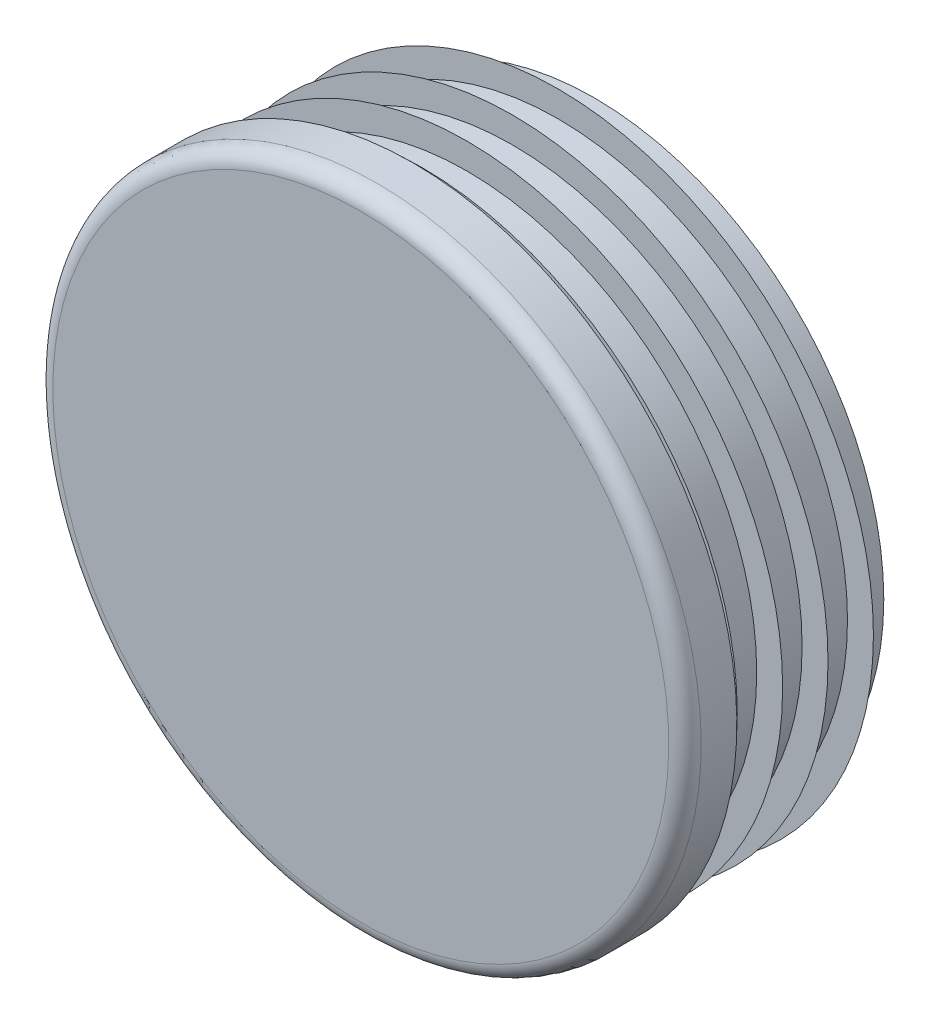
ISO-10303-21;
HEADER;
FILE_DESCRIPTION(('STEP AP214'),'2;1');
FILE_NAME('part.step','',(''),(''),'','','');
FILE_SCHEMA(('AUTOMOTIVE_DESIGN { 1 0 10303 214 1 1 1 1 }'));
ENDSEC;
DATA;
#1=APPLICATION_CONTEXT('core data for automotive mechanical design processes');
#2=APPLICATION_PROTOCOL_DEFINITION('international standard','automotive_design',2000,#1);
#3=PRODUCT_CONTEXT('',#1,'mechanical');
#4=PRODUCT('Part','Part','',(#3));
#5=PRODUCT_RELATED_PRODUCT_CATEGORY('part','',(#4));
#6=PRODUCT_DEFINITION_FORMATION('','',#4);
#7=PRODUCT_DEFINITION_CONTEXT('part definition',#1,'design');
#8=PRODUCT_DEFINITION('design','',#6,#7);
#9=PRODUCT_DEFINITION_SHAPE('','',#8);
#10=(LENGTH_UNIT() NAMED_UNIT(*) SI_UNIT(.MILLI.,.METRE.));
#11=(NAMED_UNIT(*) PLANE_ANGLE_UNIT() SI_UNIT($,.RADIAN.));
#12=(NAMED_UNIT(*) SI_UNIT($,.STERADIAN.) SOLID_ANGLE_UNIT());
#13=UNCERTAINTY_MEASURE_WITH_UNIT(LENGTH_MEASURE(1.E-05),#10,'distance_accuracy_value','');
#14=(GEOMETRIC_REPRESENTATION_CONTEXT(3) GLOBAL_UNCERTAINTY_ASSIGNED_CONTEXT((#13)) GLOBAL_UNIT_ASSIGNED_CONTEXT((#10,
#11,#12)) REPRESENTATION_CONTEXT('',''));
#15=CARTESIAN_POINT('',(0.,0.,0.));
#16=DIRECTION('',(0.,0.,1.));
#17=DIRECTION('',(1.,0.,0.));
#18=AXIS2_PLACEMENT_3D('',#15,#16,#17);
#19=CARTESIAN_POINT('',(0.,0.,6.));
#20=DIRECTION('',(0.,0.,-1.));
#21=DIRECTION('',(0.,1.,0.));
#22=AXIS2_PLACEMENT_3D('',#19,#20,#21);
#23=PLANE('',#22);
#24=CARTESIAN_POINT('',(0.,0.,6.));
#25=DIRECTION('',(0.,0.,-1.));
#26=DIRECTION('',(0.,1.,0.));
#27=AXIS2_PLACEMENT_3D('',#24,#25,#26);
#28=CIRCLE('',#27,35.625);
#29=CARTESIAN_POINT('',(0.,35.625,6.));
#30=VERTEX_POINT('',#29);
#31=EDGE_CURVE('E8',#30,#30,#28,.T.);
#32=ORIENTED_EDGE('',*,*,#31,.F.);
#33=EDGE_LOOP('',(#32));
#34=FACE_BOUND('',#33,.T.);
#35=ADVANCED_FACE('F12',(#34),#23,.F.);
#36=CARTESIAN_POINT('',(0.,0.,4.125));
#37=DIRECTION('',(0.,0.,-1.));
#38=DIRECTION('',(0.,1.,0.));
#39=AXIS2_PLACEMENT_3D('',#36,#37,#38);
#40=TOROIDAL_SURFACE('',#39,35.625,1.875);
#41=ORIENTED_EDGE('',*,*,#31,.T.);
#42=EDGE_LOOP('',(#41));
#43=FACE_BOUND('',#42,.T.);
#44=CARTESIAN_POINT('',(0.,0.,4.125));
#45=DIRECTION('',(0.,0.,-1.));
#46=DIRECTION('',(0.,1.,0.));
#47=AXIS2_PLACEMENT_3D('',#44,#45,#46);
#48=CIRCLE('',#47,37.5);
#49=CARTESIAN_POINT('',(0.,37.5,4.125));
#50=VERTEX_POINT('',#49);
#51=EDGE_CURVE('E18',#50,#50,#48,.T.);
#52=ORIENTED_EDGE('',*,*,#51,.F.);
#53=EDGE_LOOP('',(#52));
#54=FACE_BOUND('',#53,.T.);
#55=ADVANCED_FACE('F159',(#43,#54),#40,.T.);
#56=CARTESIAN_POINT('',(0.,0.,-21.));
#57=DIRECTION('',(0.,0.,-1.));
#58=DIRECTION('',(0.,1.,0.));
#59=AXIS2_PLACEMENT_3D('',#56,#57,#58);
#60=CYLINDRICAL_SURFACE('',#59,37.5);
#61=CARTESIAN_POINT('',(0.,0.,0.));
#62=DIRECTION('',(0.,0.,-1.));
#63=DIRECTION('',(0.,1.,0.));
#64=AXIS2_PLACEMENT_3D('',#61,#62,#63);
#65=CIRCLE('',#64,37.5);
#66=CARTESIAN_POINT('',(0.,37.5,0.));
#67=VERTEX_POINT('',#66);
#68=EDGE_CURVE('E22',#67,#67,#65,.T.);
#69=ORIENTED_EDGE('',*,*,#68,.F.);
#70=EDGE_LOOP('',(#69));
#71=FACE_BOUND('',#70,.T.);
#72=ORIENTED_EDGE('',*,*,#51,.T.);
#73=EDGE_LOOP('',(#72));
#74=FACE_BOUND('',#73,.T.);
#75=ADVANCED_FACE('F154',(#71,#74),#60,.T.);
#76=CARTESIAN_POINT('',(37.5,0.,0.));
#77=DIRECTION('',(0.,0.,1.));
#78=DIRECTION('',(0.,-1.,0.));
#79=AXIS2_PLACEMENT_3D('',#76,#77,#78);
#80=PLANE('',#79);
#81=CARTESIAN_POINT('',(0.,0.,0.));
#82=DIRECTION('',(0.,0.,-1.));
#83=DIRECTION('',(0.,1.,0.));
#84=AXIS2_PLACEMENT_3D('',#81,#82,#83);
#85=CIRCLE('',#84,33.5);
#86=CARTESIAN_POINT('',(0.,33.5,0.));
#87=VERTEX_POINT('',#86);
#88=EDGE_CURVE('E26',#87,#87,#85,.T.);
#89=ORIENTED_EDGE('',*,*,#88,.F.);
#90=EDGE_LOOP('',(#89));
#91=FACE_BOUND('',#90,.T.);
#92=ORIENTED_EDGE('',*,*,#68,.T.);
#93=EDGE_LOOP('',(#92));
#94=FACE_BOUND('',#93,.T.);
#95=ADVANCED_FACE('F148',(#91,#94),#80,.F.);
#96=CARTESIAN_POINT('',(0.,0.,-21.));
#97=DIRECTION('',(0.,0.,-1.));
#98=DIRECTION('',(0.,1.,0.));
#99=AXIS2_PLACEMENT_3D('',#96,#97,#98);
#100=CYLINDRICAL_SURFACE('',#99,33.5);
#101=CARTESIAN_POINT('',(0.,0.,-1.05));
#102=DIRECTION('',(0.,0.,-1.));
#103=DIRECTION('',(0.,1.,0.));
#104=AXIS2_PLACEMENT_3D('',#101,#102,#103);
#105=CIRCLE('',#104,33.5);
#106=CARTESIAN_POINT('',(0.,33.5,-1.05));
#107=VERTEX_POINT('',#106);
#108=EDGE_CURVE('E31',#107,#107,#105,.T.);
#109=ORIENTED_EDGE('',*,*,#108,.F.);
#110=EDGE_LOOP('',(#109));
#111=FACE_BOUND('',#110,.T.);
#112=ORIENTED_EDGE('',*,*,#88,.T.);
#113=EDGE_LOOP('',(#112));
#114=FACE_BOUND('',#113,.T.);
#115=ADVANCED_FACE('F142',(#111,#114),#100,.T.);
#116=CARTESIAN_POINT('',(33.5,0.,-1.05));
#117=DIRECTION('',(0.,0.,-1.));
#118=DIRECTION('',(0.,1.,0.));
#119=AXIS2_PLACEMENT_3D('',#116,#117,#118);
#120=PLANE('',#119);
#121=CARTESIAN_POINT('',(0.,0.,-1.05));
#122=DIRECTION('',(0.,0.,-1.));
#123=DIRECTION('',(0.,1.,0.));
#124=AXIS2_PLACEMENT_3D('',#121,#122,#123);
#125=CIRCLE('',#124,36.5);
#126=CARTESIAN_POINT('',(0.,36.5,-1.05));
#127=VERTEX_POINT('',#126);
#128=EDGE_CURVE('E34',#127,#127,#125,.T.);
#129=ORIENTED_EDGE('',*,*,#128,.F.);
#130=EDGE_LOOP('',(#129));
#131=FACE_BOUND('',#130,.T.);
#132=ORIENTED_EDGE('',*,*,#108,.T.);
#133=EDGE_LOOP('',(#132));
#134=FACE_BOUND('',#133,.T.);
#135=ADVANCED_FACE('F136',(#131,#134),#120,.F.);
#136=CARTESIAN_POINT('',(0.,0.,-1.05));
#137=DIRECTION('',(0.,0.,1.));
#138=DIRECTION('',(0.,-1.,0.));
#139=AXIS2_PLACEMENT_3D('',#136,#137,#138);
#140=CONICAL_SURFACE('',#139,36.5,0.959931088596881);
#141=CARTESIAN_POINT('',(0.,0.,-3.15062261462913));
#142=DIRECTION('',(0.,0.,-1.));
#143=DIRECTION('',(0.,1.,0.));
#144=AXIS2_PLACEMENT_3D('',#141,#142,#143);
#145=CIRCLE('',#144,33.5);
#146=CARTESIAN_POINT('',(0.,33.5,-3.15062261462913));
#147=VERTEX_POINT('',#146);
#148=EDGE_CURVE('E37',#147,#147,#145,.T.);
#149=ORIENTED_EDGE('',*,*,#148,.F.);
#150=EDGE_LOOP('',(#149));
#151=FACE_BOUND('',#150,.T.);
#152=ORIENTED_EDGE('',*,*,#128,.T.);
#153=EDGE_LOOP('',(#152));
#154=FACE_BOUND('',#153,.T.);
#155=ADVANCED_FACE('F130',(#151,#154),#140,.T.);
#156=CARTESIAN_POINT('',(0.,0.,-21.));
#157=DIRECTION('',(0.,0.,-1.));
#158=DIRECTION('',(0.,1.,0.));
#159=AXIS2_PLACEMENT_3D('',#156,#157,#158);
#160=CYLINDRICAL_SURFACE('',#159,33.5);
#161=CARTESIAN_POINT('',(0.,0.,-6.3));
#162=DIRECTION('',(0.,0.,-1.));
#163=DIRECTION('',(0.,1.,0.));
#164=AXIS2_PLACEMENT_3D('',#161,#162,#163);
#165=CIRCLE('',#164,33.5);
#166=CARTESIAN_POINT('',(0.,33.5,-6.3));
#167=VERTEX_POINT('',#166);
#168=EDGE_CURVE('E40',#167,#167,#165,.T.);
#169=ORIENTED_EDGE('',*,*,#168,.F.);
#170=EDGE_LOOP('',(#169));
#171=FACE_BOUND('',#170,.T.);
#172=ORIENTED_EDGE('',*,*,#148,.T.);
#173=EDGE_LOOP('',(#172));
#174=FACE_BOUND('',#173,.T.);
#175=ADVANCED_FACE('F124',(#171,#174),#160,.T.);
#176=CARTESIAN_POINT('',(33.5,0.,-6.3));
#177=DIRECTION('',(0.,0.,-1.));
#178=DIRECTION('',(0.,1.,0.));
#179=AXIS2_PLACEMENT_3D('',#176,#177,#178);
#180=PLANE('',#179);
#181=CARTESIAN_POINT('',(0.,0.,-6.3));
#182=DIRECTION('',(0.,0.,-1.));
#183=DIRECTION('',(0.,1.,0.));
#184=AXIS2_PLACEMENT_3D('',#181,#182,#183);
#185=CIRCLE('',#184,36.5);
#186=CARTESIAN_POINT('',(0.,36.5,-6.3));
#187=VERTEX_POINT('',#186);
#188=EDGE_CURVE('E43',#187,#187,#185,.T.);
#189=ORIENTED_EDGE('',*,*,#188,.F.);
#190=EDGE_LOOP('',(#189));
#191=FACE_BOUND('',#190,.T.);
#192=ORIENTED_EDGE('',*,*,#168,.T.);
#193=EDGE_LOOP('',(#192));
#194=FACE_BOUND('',#193,.T.);
#195=ADVANCED_FACE('F118',(#191,#194),#180,.F.);
#196=CARTESIAN_POINT('',(0.,0.,-6.3));
#197=DIRECTION('',(0.,0.,1.));
#198=DIRECTION('',(0.,-1.,0.));
#199=AXIS2_PLACEMENT_3D('',#196,#197,#198);
#200=CONICAL_SURFACE('',#199,36.5,0.959931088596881);
#201=CARTESIAN_POINT('',(0.,0.,-8.40062261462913));
#202=DIRECTION('',(0.,0.,-1.));
#203=DIRECTION('',(0.,1.,0.));
#204=AXIS2_PLACEMENT_3D('',#201,#202,#203);
#205=CIRCLE('',#204,33.5);
#206=CARTESIAN_POINT('',(0.,33.5,-8.40062261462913));
#207=VERTEX_POINT('',#206);
#208=EDGE_CURVE('E46',#207,#207,#205,.T.);
#209=ORIENTED_EDGE('',*,*,#208,.F.);
#210=EDGE_LOOP('',(#209));
#211=FACE_BOUND('',#210,.T.);
#212=ORIENTED_EDGE('',*,*,#188,.T.);
#213=EDGE_LOOP('',(#212));
#214=FACE_BOUND('',#213,.T.);
#215=ADVANCED_FACE('F112',(#211,#214),#200,.T.);
#216=CARTESIAN_POINT('',(0.,0.,-21.));
#217=DIRECTION('',(0.,0.,-1.));
#218=DIRECTION('',(0.,1.,0.));
#219=AXIS2_PLACEMENT_3D('',#216,#217,#218);
#220=CYLINDRICAL_SURFACE('',#219,33.5);
#221=CARTESIAN_POINT('',(0.,0.,-11.55));
#222=DIRECTION('',(0.,0.,-1.));
#223=DIRECTION('',(0.,1.,0.));
#224=AXIS2_PLACEMENT_3D('',#221,#222,#223);
#225=CIRCLE('',#224,33.5);
#226=CARTESIAN_POINT('',(0.,33.5,-11.55));
#227=VERTEX_POINT('',#226);
#228=EDGE_CURVE('E49',#227,#227,#225,.T.);
#229=ORIENTED_EDGE('',*,*,#228,.F.);
#230=EDGE_LOOP('',(#229));
#231=FACE_BOUND('',#230,.T.);
#232=ORIENTED_EDGE('',*,*,#208,.T.);
#233=EDGE_LOOP('',(#232));
#234=FACE_BOUND('',#233,.T.);
#235=ADVANCED_FACE('F106',(#231,#234),#220,.T.);
#236=CARTESIAN_POINT('',(33.5,0.,-11.55));
#237=DIRECTION('',(0.,0.,-1.));
#238=DIRECTION('',(0.,1.,0.));
#239=AXIS2_PLACEMENT_3D('',#236,#237,#238);
#240=PLANE('',#239);
#241=CARTESIAN_POINT('',(0.,0.,-11.55));
#242=DIRECTION('',(0.,0.,-1.));
#243=DIRECTION('',(0.,1.,0.));
#244=AXIS2_PLACEMENT_3D('',#241,#242,#243);
#245=CIRCLE('',#244,36.5);
#246=CARTESIAN_POINT('',(0.,36.5,-11.55));
#247=VERTEX_POINT('',#246);
#248=EDGE_CURVE('E52',#247,#247,#245,.T.);
#249=ORIENTED_EDGE('',*,*,#248,.F.);
#250=EDGE_LOOP('',(#249));
#251=FACE_BOUND('',#250,.T.);
#252=ORIENTED_EDGE('',*,*,#228,.T.);
#253=EDGE_LOOP('',(#252));
#254=FACE_BOUND('',#253,.T.);
#255=ADVANCED_FACE('F100',(#251,#254),#240,.F.);
#256=CARTESIAN_POINT('',(0.,0.,-11.55));
#257=DIRECTION('',(0.,0.,1.));
#258=DIRECTION('',(0.,-1.,0.));
#259=AXIS2_PLACEMENT_3D('',#256,#257,#258);
#260=CONICAL_SURFACE('',#259,36.5,0.959931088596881);
#261=CARTESIAN_POINT('',(0.,0.,-13.6506226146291));
#262=DIRECTION('',(0.,0.,-1.));
#263=DIRECTION('',(0.,1.,0.));
#264=AXIS2_PLACEMENT_3D('',#261,#262,#263);
#265=CIRCLE('',#264,33.5);
#266=CARTESIAN_POINT('',(0.,33.5,-13.6506226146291));
#267=VERTEX_POINT('',#266);
#268=EDGE_CURVE('E55',#267,#267,#265,.T.);
#269=ORIENTED_EDGE('',*,*,#268,.F.);
#270=EDGE_LOOP('',(#269));
#271=FACE_BOUND('',#270,.T.);
#272=ORIENTED_EDGE('',*,*,#248,.T.);
#273=EDGE_LOOP('',(#272));
#274=FACE_BOUND('',#273,.T.);
#275=ADVANCED_FACE('F94',(#271,#274),#260,.T.);
#276=CARTESIAN_POINT('',(0.,0.,-21.));
#277=DIRECTION('',(0.,0.,-1.));
#278=DIRECTION('',(0.,1.,0.));
#279=AXIS2_PLACEMENT_3D('',#276,#277,#278);
#280=CYLINDRICAL_SURFACE('',#279,33.5);
#281=CARTESIAN_POINT('',(0.,0.,-16.8));
#282=DIRECTION('',(0.,0.,-1.));
#283=DIRECTION('',(0.,1.,0.));
#284=AXIS2_PLACEMENT_3D('',#281,#282,#283);
#285=CIRCLE('',#284,33.5);
#286=CARTESIAN_POINT('',(0.,33.5,-16.8));
#287=VERTEX_POINT('',#286);
#288=EDGE_CURVE('E58',#287,#287,#285,.T.);
#289=ORIENTED_EDGE('',*,*,#288,.F.);
#290=EDGE_LOOP('',(#289));
#291=FACE_BOUND('',#290,.T.);
#292=ORIENTED_EDGE('',*,*,#268,.T.);
#293=EDGE_LOOP('',(#292));
#294=FACE_BOUND('',#293,.T.);
#295=ADVANCED_FACE('F88',(#291,#294),#280,.T.);
#296=CARTESIAN_POINT('',(33.5,0.,-16.8));
#297=DIRECTION('',(0.,0.,-1.));
#298=DIRECTION('',(0.,1.,0.));
#299=AXIS2_PLACEMENT_3D('',#296,#297,#298);
#300=PLANE('',#299);
#301=CARTESIAN_POINT('',(0.,0.,-16.8));
#302=DIRECTION('',(0.,0.,-1.));
#303=DIRECTION('',(0.,1.,0.));
#304=AXIS2_PLACEMENT_3D('',#301,#302,#303);
#305=CIRCLE('',#304,36.5);
#306=CARTESIAN_POINT('',(0.,36.5,-16.8));
#307=VERTEX_POINT('',#306);
#308=EDGE_CURVE('E61',#307,#307,#305,.T.);
#309=ORIENTED_EDGE('',*,*,#308,.F.);
#310=EDGE_LOOP('',(#309));
#311=FACE_BOUND('',#310,.T.);
#312=ORIENTED_EDGE('',*,*,#288,.T.);
#313=EDGE_LOOP('',(#312));
#314=FACE_BOUND('',#313,.T.);
#315=ADVANCED_FACE('F82',(#311,#314),#300,.F.);
#316=CARTESIAN_POINT('',(0.,0.,-16.8));
#317=DIRECTION('',(0.,0.,1.));
#318=DIRECTION('',(0.,-1.,0.));
#319=AXIS2_PLACEMENT_3D('',#316,#317,#318);
#320=CONICAL_SURFACE('',#319,36.5,0.959931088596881);
#321=CARTESIAN_POINT('',(0.,0.,-18.9006226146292));
#322=DIRECTION('',(0.,0.,-1.));
#323=DIRECTION('',(0.,1.,0.));
#324=AXIS2_PLACEMENT_3D('',#321,#322,#323);
#325=CIRCLE('',#324,33.5);
#326=CARTESIAN_POINT('',(0.,33.5,-18.9006226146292));
#327=VERTEX_POINT('',#326);
#328=EDGE_CURVE('E64',#327,#327,#325,.T.);
#329=ORIENTED_EDGE('',*,*,#328,.F.);
#330=EDGE_LOOP('',(#329));
#331=FACE_BOUND('',#330,.T.);
#332=ORIENTED_EDGE('',*,*,#308,.T.);
#333=EDGE_LOOP('',(#332));
#334=FACE_BOUND('',#333,.T.);
#335=ADVANCED_FACE('F76',(#331,#334),#320,.T.);
#336=CARTESIAN_POINT('',(0.,0.,-21.));
#337=DIRECTION('',(0.,0.,-1.));
#338=DIRECTION('',(0.,1.,0.));
#339=AXIS2_PLACEMENT_3D('',#336,#337,#338);
#340=CYLINDRICAL_SURFACE('',#339,33.5);
#341=CARTESIAN_POINT('',(0.,0.,-21.));
#342=DIRECTION('',(0.,0.,-1.));
#343=DIRECTION('',(0.,1.,0.));
#344=AXIS2_PLACEMENT_3D('',#341,#342,#343);
#345=CIRCLE('',#344,33.5);
#346=CARTESIAN_POINT('',(0.,33.5,-21.));
#347=VERTEX_POINT('',#346);
#348=EDGE_CURVE('E67',#347,#347,#345,.T.);
#349=ORIENTED_EDGE('',*,*,#348,.F.);
#350=EDGE_LOOP('',(#349));
#351=FACE_BOUND('',#350,.T.);
#352=ORIENTED_EDGE('',*,*,#328,.T.);
#353=EDGE_LOOP('',(#352));
#354=FACE_BOUND('',#353,.T.);
#355=ADVANCED_FACE('F73',(#351,#354),#340,.T.);
#356=CARTESIAN_POINT('',(33.5,0.,-21.));
#357=DIRECTION('',(0.,0.,1.));
#358=DIRECTION('',(0.,-1.,0.));
#359=AXIS2_PLACEMENT_3D('',#356,#357,#358);
#360=PLANE('',#359);
#361=ORIENTED_EDGE('',*,*,#348,.T.);
#362=EDGE_LOOP('',(#361));
#363=FACE_BOUND('',#362,.T.);
#364=ADVANCED_FACE('F71',(#363),#360,.F.);
#365=CLOSED_SHELL('',(#35,#55,#75,#95,#115,#135,#155,#175,#195,#215,#235,#255,#275,#295,#315,
#335,#355,#364));
#366=MANIFOLD_SOLID_BREP('B1',#365);
#367=ADVANCED_BREP_SHAPE_REPRESENTATION('',(#18,#366),#14);
#368=SHAPE_DEFINITION_REPRESENTATION(#9,#367);
ENDSEC;
END-ISO-10303-21;
